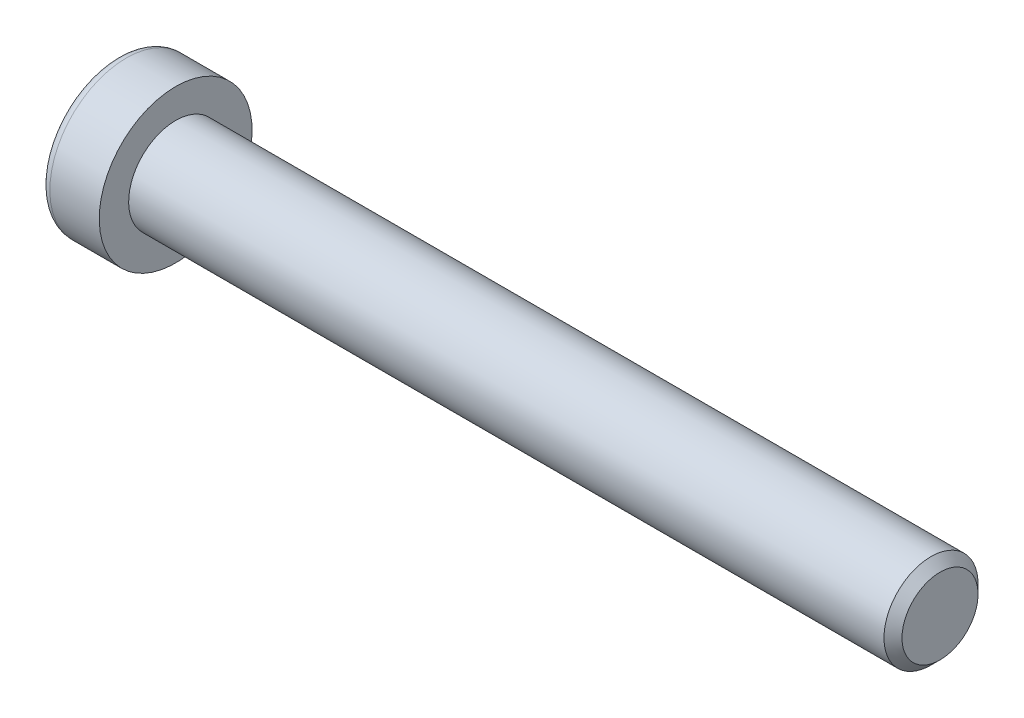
ISO-10303-21;
HEADER;
FILE_DESCRIPTION(('STEP AP214'),'2;1');
FILE_NAME('part.step','',(''),(''),'','','');
FILE_SCHEMA(('AUTOMOTIVE_DESIGN { 1 0 10303 214 1 1 1 1 }'));
ENDSEC;
DATA;
#1=APPLICATION_CONTEXT('core data for automotive mechanical design processes');
#2=APPLICATION_PROTOCOL_DEFINITION('international standard','automotive_design',2000,#1);
#3=PRODUCT_CONTEXT('',#1,'mechanical');
#4=PRODUCT('Part','Part','',(#3));
#5=PRODUCT_RELATED_PRODUCT_CATEGORY('part','',(#4));
#6=PRODUCT_DEFINITION_FORMATION('','',#4);
#7=PRODUCT_DEFINITION_CONTEXT('part definition',#1,'design');
#8=PRODUCT_DEFINITION('design','',#6,#7);
#9=PRODUCT_DEFINITION_SHAPE('','',#8);
#10=(LENGTH_UNIT() NAMED_UNIT(*) SI_UNIT(.MILLI.,.METRE.));
#11=(NAMED_UNIT(*) PLANE_ANGLE_UNIT() SI_UNIT($,.RADIAN.));
#12=(NAMED_UNIT(*) SI_UNIT($,.STERADIAN.) SOLID_ANGLE_UNIT());
#13=UNCERTAINTY_MEASURE_WITH_UNIT(LENGTH_MEASURE(1.E-05),#10,'distance_accuracy_value','');
#14=(GEOMETRIC_REPRESENTATION_CONTEXT(3) GLOBAL_UNCERTAINTY_ASSIGNED_CONTEXT((#13)) GLOBAL_UNIT_ASSIGNED_CONTEXT((#10,
#11,#12)) REPRESENTATION_CONTEXT('',''));
#15=CARTESIAN_POINT('',(0.,0.,0.));
#16=DIRECTION('',(0.,0.,1.));
#17=DIRECTION('',(1.,0.,0.));
#18=AXIS2_PLACEMENT_3D('',#15,#16,#17);
#19=CARTESIAN_POINT('',(-1.21000000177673,0.,0.));
#20=DIRECTION('',(-1.,0.,0.));
#21=DIRECTION('',(0.,0.,1.));
#22=AXIS2_PLACEMENT_3D('',#19,#20,#21);
#23=CONICAL_SURFACE('',#22,2.9040718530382,1.04719754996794);
#24=CARTESIAN_POINT('',(0.466666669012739,-1.13686837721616E-10,0.));
#25=VERTEX_POINT('',#24);
#26=VERTEX_LOOP('',#25);
#27=FACE_BOUND('',#26,.T.);
#28=CARTESIAN_POINT('',(-1.20000000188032,2.50000000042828,1.44337567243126));
#29=CARTESIAN_POINT('',(-1.16336943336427,2.50000000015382,1.31652043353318));
#30=CARTESIAN_POINT('',(-1.13005584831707,2.50000000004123,1.18857018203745));
#31=CARTESIAN_POINT('',(-1.07190798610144,2.49999999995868,0.930454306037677));
#32=CARTESIAN_POINT('',(-1.04709427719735,2.49999999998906,0.800284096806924));
#33=CARTESIAN_POINT('',(-1.00846995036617,2.50000000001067,0.541556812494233));
#34=CARTESIAN_POINT('',(-0.994402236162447,2.50000000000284,0.413039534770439));
#35=CARTESIAN_POINT('',(-0.977611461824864,2.49999999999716,0.155400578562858));
#36=CARTESIAN_POINT('',(-0.974874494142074,2.49999999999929,0.0262798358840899));
#37=CARTESIAN_POINT('',(-0.980582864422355,2.50000000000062,-0.21496841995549));
#38=CARTESIAN_POINT('',(-0.987626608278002,2.50000000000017,-0.327132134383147));
#39=CARTESIAN_POINT('',(-1.00994662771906,2.49999999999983,-0.550728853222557));
#40=CARTESIAN_POINT('',(-1.02523052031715,2.49999999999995,-0.66216108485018));
#41=CARTESIAN_POINT('',(-1.06343729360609,2.50000000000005,-0.886218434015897));
#42=CARTESIAN_POINT('',(-1.08652205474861,2.50000000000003,-0.998815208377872));
#43=CARTESIAN_POINT('',(-1.13891470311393,2.49999999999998,-1.2223298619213));
#44=CARTESIAN_POINT('',(-1.16821028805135,2.49999999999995,-1.33325060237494));
#45=CARTESIAN_POINT('',(-1.20000000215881,2.5,-1.44337567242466));
#46=B_SPLINE_CURVE_WITH_KNOTS('',3,(#28,#29,#30,#31,#32,#33,#34,#35,#36,#37,#38,#39,#40,#41,#42,
#43,#44,#45),.UNSPECIFIED.,.F.,.F.,(4,2,2,2,2,2,2,2,4),(0.,0.396270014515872,0.793492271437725,
1.18088450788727,1.56780111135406,1.90463472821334,2.24178024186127,2.58640202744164,
2.93034746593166),.UNSPECIFIED.);
#47=CARTESIAN_POINT('',(-1.20000000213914,2.49999999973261,1.44337567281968));
#48=VERTEX_POINT('',#47);
#49=CARTESIAN_POINT('',(-1.20000000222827,2.5,-1.44337567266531));
#50=VERTEX_POINT('',#49);
#51=EDGE_CURVE('E20',#48,#50,#46,.T.);
#52=ORIENTED_EDGE('',*,*,#51,.T.);
#53=CARTESIAN_POINT('',(-1.20000000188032,2.49999999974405,-1.44337567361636));
#54=CARTESIAN_POINT('',(-1.16336943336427,2.39014014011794,-1.50680329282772));
#55=CARTESIAN_POINT('',(-1.13005584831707,2.27933197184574,-1.57077841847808));
#56=CARTESIAN_POINT('',(-1.07190798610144,2.05579706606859,-1.69983635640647));
#57=CARTESIAN_POINT('',(-1.04709427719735,1.94306635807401,-1.76492146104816));
#58=CARTESIAN_POINT('',(-1.00846995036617,1.71900195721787,-1.89428510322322));
#59=CARTESIAN_POINT('',(-0.994402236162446,1.60770272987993,-1.95854374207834));
#60=CARTESIAN_POINT('',(-0.977611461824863,1.38458084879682,-2.08736322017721));
#61=CARTESIAN_POINT('',(-0.974874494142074,1.27275900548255,-2.15192359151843));
#62=CARTESIAN_POINT('',(-0.980582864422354,1.06383188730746,-2.27254771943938));
#63=CARTESIAN_POINT('',(-0.987626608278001,0.966695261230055,-2.32862957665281));
#64=CARTESIAN_POINT('',(-1.00994662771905,0.773054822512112,-2.44042793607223));
#65=CARTESIAN_POINT('',(-1.02523052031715,0.676551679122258,-2.49614405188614));
#66=CARTESIAN_POINT('',(-1.06343729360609,0.482512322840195,-2.60817272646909));
#67=CARTESIAN_POINT('',(-1.08652205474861,0.385000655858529,-2.66447111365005));
#68=CARTESIAN_POINT('',(-1.13891470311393,0.191431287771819,-2.77622844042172));
#69=CARTESIAN_POINT('',(-1.16821028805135,0.09537110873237,-2.83168881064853));
#70=CARTESIAN_POINT('',(-1.20000000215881,4.75795614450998E-10,-2.88675134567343));
#71=B_SPLINE_CURVE_WITH_KNOTS('',3,(#53,#54,#55,#56,#57,#58,#59,#60,#61,#62,#63,#64,#65,#66,#67,
#68,#69,#70),.UNSPECIFIED.,.F.,.F.,(4,2,2,2,2,2,2,2,4),(0.,0.396270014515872,0.793492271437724,
1.18088450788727,1.56780111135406,1.90463472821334,2.24178024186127,2.58640202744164,
2.93034746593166),.UNSPECIFIED.);
#72=CARTESIAN_POINT('',(-1.20000000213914,0.,-2.88675134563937));
#73=VERTEX_POINT('',#72);
#74=EDGE_CURVE('E80',#50,#73,#71,.T.);
#75=ORIENTED_EDGE('',*,*,#74,.T.);
#76=CARTESIAN_POINT('',(-1.20000000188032,-6.84219602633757E-10,-2.88675134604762));
#77=CARTESIAN_POINT('',(-1.16336943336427,-0.109859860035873,-2.8233237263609));
#78=CARTESIAN_POINT('',(-1.13005584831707,-0.220668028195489,-2.75934860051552));
#79=CARTESIAN_POINT('',(-1.07190798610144,-0.444202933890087,-2.63029066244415));
#80=CARTESIAN_POINT('',(-1.04709427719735,-0.556933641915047,-2.56520555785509));
#81=CARTESIAN_POINT('',(-1.00846995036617,-0.780998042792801,-2.43584191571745));
#82=CARTESIAN_POINT('',(-0.994402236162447,-0.892297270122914,-2.37158327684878));
#83=CARTESIAN_POINT('',(-0.977611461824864,-1.11541915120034,-2.24276379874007));
#84=CARTESIAN_POINT('',(-0.974874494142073,-1.22724099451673,-2.17820342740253));
#85=CARTESIAN_POINT('',(-0.980582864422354,-1.43616811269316,-2.05757929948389));
#86=CARTESIAN_POINT('',(-0.987626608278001,-1.53330473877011,-2.00149744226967));
#87=CARTESIAN_POINT('',(-1.00994662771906,-1.72694517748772,-1.88969908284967));
#88=CARTESIAN_POINT('',(-1.02523052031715,-1.82344832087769,-1.83398296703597));
#89=CARTESIAN_POINT('',(-1.06343729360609,-2.01748767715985,-1.72195429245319));
#90=CARTESIAN_POINT('',(-1.08652205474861,-2.1149993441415,-1.66565590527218));
#91=CARTESIAN_POINT('',(-1.13891470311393,-2.30856871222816,-1.55389857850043));
#92=CARTESIAN_POINT('',(-1.16821028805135,-2.40462889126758,-1.49843820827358));
#93=CARTESIAN_POINT('',(-1.20000000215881,-2.49999999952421,-1.44337567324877));
#94=B_SPLINE_CURVE_WITH_KNOTS('',3,(#76,#77,#78,#79,#80,#81,#82,#83,#84,#85,#86,#87,#88,#89,#90,
#91,#92,#93),.UNSPECIFIED.,.F.,.F.,(4,2,2,2,2,2,2,2,4),(0.,0.396270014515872,0.793492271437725,
1.18088450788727,1.56780111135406,1.90463472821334,2.24178024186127,2.58640202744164,
2.93034746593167),.UNSPECIFIED.);
#95=CARTESIAN_POINT('',(-1.20000000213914,-2.49999999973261,-1.44337567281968));
#96=VERTEX_POINT('',#95);
#97=EDGE_CURVE('E105',#73,#96,#94,.T.);
#98=ORIENTED_EDGE('',*,*,#97,.T.);
#99=CARTESIAN_POINT('',(-1.20000000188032,-2.50000000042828,-1.44337567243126));
#100=CARTESIAN_POINT('',(-1.16336943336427,-2.50000000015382,-1.31652043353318));
#101=CARTESIAN_POINT('',(-1.13005584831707,-2.50000000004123,-1.18857018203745));
#102=CARTESIAN_POINT('',(-1.07190798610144,-2.49999999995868,-0.93045430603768));
#103=CARTESIAN_POINT('',(-1.04709427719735,-2.49999999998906,-0.800284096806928));
#104=CARTESIAN_POINT('',(-1.00846995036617,-2.50000000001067,-0.541556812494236));
#105=CARTESIAN_POINT('',(-0.994402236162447,-2.50000000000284,-0.413039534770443));
#106=CARTESIAN_POINT('',(-0.977611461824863,-2.49999999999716,-0.155400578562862));
#107=CARTESIAN_POINT('',(-0.974874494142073,-2.49999999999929,-0.0262798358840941));
#108=CARTESIAN_POINT('',(-0.980582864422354,-2.50000000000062,0.214968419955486));
#109=CARTESIAN_POINT('',(-0.987626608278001,-2.50000000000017,0.327132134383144));
#110=CARTESIAN_POINT('',(-1.00994662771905,-2.49999999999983,0.550728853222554));
#111=CARTESIAN_POINT('',(-1.02523052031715,-2.49999999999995,0.662161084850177));
#112=CARTESIAN_POINT('',(-1.06343729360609,-2.50000000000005,0.886218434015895));
#113=CARTESIAN_POINT('',(-1.08652205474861,-2.50000000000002,0.99881520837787));
#114=CARTESIAN_POINT('',(-1.13891470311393,-2.49999999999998,1.2223298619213));
#115=CARTESIAN_POINT('',(-1.16821028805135,-2.49999999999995,1.33325060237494));
#116=CARTESIAN_POINT('',(-1.20000000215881,-2.5,1.44337567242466));
#117=B_SPLINE_CURVE_WITH_KNOTS('',3,(#99,#100,#101,#102,#103,#104,#105,#106,#107,#108,#109,#110,
#111,#112,#113,#114,#115,#116),.UNSPECIFIED.,.F.,.F.,(4,2,2,2,2,2,2,2,4),(0.,0.396270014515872,
0.793492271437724,1.18088450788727,1.56780111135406,1.90463472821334,2.24178024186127,
2.58640202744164,2.93034746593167),.UNSPECIFIED.);
#118=CARTESIAN_POINT('',(-1.20000000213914,-2.49999999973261,1.44337567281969));
#119=VERTEX_POINT('',#118);
#120=EDGE_CURVE('E129',#96,#119,#117,.T.);
#121=ORIENTED_EDGE('',*,*,#120,.T.);
#122=CARTESIAN_POINT('',(-1.20000000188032,-2.49999999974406,1.44337567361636));
#123=CARTESIAN_POINT('',(-1.16336943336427,-2.39014014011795,1.50680329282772));
#124=CARTESIAN_POINT('',(-1.13005584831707,-2.27933197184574,1.57077841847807));
#125=CARTESIAN_POINT('',(-1.07190798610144,-2.05579706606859,1.69983635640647));
#126=CARTESIAN_POINT('',(-1.04709427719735,-1.94306635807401,1.76492146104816));
#127=CARTESIAN_POINT('',(-1.00846995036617,-1.71900195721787,1.89428510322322));
#128=CARTESIAN_POINT('',(-0.994402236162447,-1.60770272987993,1.95854374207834));
#129=CARTESIAN_POINT('',(-0.977611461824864,-1.38458084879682,2.08736322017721));
#130=CARTESIAN_POINT('',(-0.974874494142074,-1.27275900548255,2.15192359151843));
#131=CARTESIAN_POINT('',(-0.980582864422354,-1.06383188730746,2.27254771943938));
#132=CARTESIAN_POINT('',(-0.987626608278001,-0.966695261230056,2.32862957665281));
#133=CARTESIAN_POINT('',(-1.00994662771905,-0.773054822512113,2.44042793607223));
#134=CARTESIAN_POINT('',(-1.02523052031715,-0.676551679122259,2.49614405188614));
#135=CARTESIAN_POINT('',(-1.06343729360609,-0.482512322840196,2.60817272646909));
#136=CARTESIAN_POINT('',(-1.08652205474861,-0.385000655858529,2.66447111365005));
#137=CARTESIAN_POINT('',(-1.13891470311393,-0.19143128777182,2.77622844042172));
#138=CARTESIAN_POINT('',(-1.16821028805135,-0.0953711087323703,2.83168881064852));
#139=CARTESIAN_POINT('',(-1.20000000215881,-4.75795563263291E-10,2.88675134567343));
#140=B_SPLINE_CURVE_WITH_KNOTS('',3,(#122,#123,#124,#125,#126,#127,#128,#129,#130,#131,#132,
#133,#134,#135,#136,#137,#138,#139),.UNSPECIFIED.,.F.,.F.,(4,2,2,2,2,2,2,2,4),(0.,
0.396270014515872,0.793492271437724,1.18088450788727,1.56780111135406,1.90463472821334,
2.24178024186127,2.58640202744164,2.93034746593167),.UNSPECIFIED.);
#141=CARTESIAN_POINT('',(-1.20000000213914,0.,2.88675134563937));
#142=VERTEX_POINT('',#141);
#143=EDGE_CURVE('E137',#119,#142,#140,.T.);
#144=ORIENTED_EDGE('',*,*,#143,.T.);
#145=CARTESIAN_POINT('',(-1.20000000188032,6.84218567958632E-10,2.88675134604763));
#146=CARTESIAN_POINT('',(-1.16336943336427,0.109859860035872,2.8233237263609));
#147=CARTESIAN_POINT('',(-1.13005584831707,0.220668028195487,2.75934860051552));
#148=CARTESIAN_POINT('',(-1.07190798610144,0.444202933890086,2.63029066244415));
#149=CARTESIAN_POINT('',(-1.04709427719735,0.556933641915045,2.56520555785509));
#150=CARTESIAN_POINT('',(-1.00846995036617,0.7809980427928,2.43584191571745));
#151=CARTESIAN_POINT('',(-0.994402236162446,0.892297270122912,2.37158327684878));
#152=CARTESIAN_POINT('',(-0.977611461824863,1.11541915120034,2.24276379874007));
#153=CARTESIAN_POINT('',(-0.974874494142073,1.22724099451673,2.17820342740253));
#154=CARTESIAN_POINT('',(-0.980582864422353,1.43616811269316,2.05757929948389));
#155=CARTESIAN_POINT('',(-0.987626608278,1.53330473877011,2.00149744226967));
#156=CARTESIAN_POINT('',(-1.00994662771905,1.72694517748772,1.88969908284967));
#157=CARTESIAN_POINT('',(-1.02523052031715,1.82344832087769,1.83398296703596));
#158=CARTESIAN_POINT('',(-1.06343729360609,2.01748767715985,1.72195429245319));
#159=CARTESIAN_POINT('',(-1.08652205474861,2.1149993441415,1.66565590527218));
#160=CARTESIAN_POINT('',(-1.13891470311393,2.30856871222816,1.55389857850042));
#161=CARTESIAN_POINT('',(-1.16821028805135,2.40462889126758,1.49843820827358));
#162=CARTESIAN_POINT('',(-1.2000000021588,2.49999999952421,1.44337567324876));
#163=B_SPLINE_CURVE_WITH_KNOTS('',3,(#145,#146,#147,#148,#149,#150,#151,#152,#153,#154,#155,
#156,#157,#158,#159,#160,#161,#162),.UNSPECIFIED.,.F.,.F.,(4,2,2,2,2,2,2,2,4),(0.,
0.396270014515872,0.793492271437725,1.18088450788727,1.56780111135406,1.90463472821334,
2.24178024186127,2.58640202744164,2.93034746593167),.UNSPECIFIED.);
#164=EDGE_CURVE('E82',#142,#48,#163,.T.);
#165=ORIENTED_EDGE('',*,*,#164,.T.);
#166=EDGE_LOOP('',(#52,#75,#98,#121,#144,#165));
#167=FACE_BOUND('',#166,.T.);
#168=ADVANCED_FACE('F16',(#27,#167),#23,.F.);
#169=CARTESIAN_POINT('',(-5.,2.5,1.44337567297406));
#170=DIRECTION('',(0.,1.,0.));
#171=DIRECTION('',(0.,0.,1.));
#172=AXIS2_PLACEMENT_3D('',#169,#170,#171);
#173=PLANE('',#172);
#174=DIRECTION('',(1.,0.,0.));
#175=VECTOR('',#174,1.);
#176=CARTESIAN_POINT('',(-5.,2.5,1.44337567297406));
#177=LINE('',#176,#175);
#178=CARTESIAN_POINT('',(-5.,2.5,1.44337567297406));
#179=VERTEX_POINT('',#178);
#180=EDGE_CURVE('E84',#48,#179,#177,.F.);
#181=ORIENTED_EDGE('',*,*,#180,.T.);
#182=DIRECTION('',(0.,0.,1.));
#183=VECTOR('',#182,1.);
#184=CARTESIAN_POINT('',(-5.,2.5,0.));
#185=LINE('',#184,#183);
#186=CARTESIAN_POINT('',(-5.,2.5,-1.44337567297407));
#187=VERTEX_POINT('',#186);
#188=EDGE_CURVE('E89',#187,#179,#185,.T.);
#189=ORIENTED_EDGE('',*,*,#188,.F.);
#190=DIRECTION('',(1.,0.,0.));
#191=VECTOR('',#190,1.);
#192=CARTESIAN_POINT('',(-5.,2.5,-1.44337567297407));
#193=LINE('',#192,#191);
#194=EDGE_CURVE('E87',#187,#50,#193,.T.);
#195=ORIENTED_EDGE('',*,*,#194,.T.);
#196=ORIENTED_EDGE('',*,*,#51,.F.);
#197=EDGE_LOOP('',(#181,#189,#195,#196));
#198=FACE_BOUND('',#197,.T.);
#199=ADVANCED_FACE('F76',(#198),#173,.F.);
#200=CARTESIAN_POINT('',(-5.,0.,2.88675134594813));
#201=DIRECTION('',(0.,0.500000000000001,0.866025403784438));
#202=DIRECTION('',(0.,-0.866025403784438,0.500000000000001));
#203=AXIS2_PLACEMENT_3D('',#200,#201,#202);
#204=PLANE('',#203);
#205=DIRECTION('',(1.,0.,0.));
#206=VECTOR('',#205,1.);
#207=CARTESIAN_POINT('',(-5.,0.,2.88675134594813));
#208=LINE('',#207,#206);
#209=CARTESIAN_POINT('',(-5.,0.,2.88675134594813));
#210=VERTEX_POINT('',#209);
#211=EDGE_CURVE('E141',#142,#210,#208,.F.);
#212=ORIENTED_EDGE('',*,*,#211,.T.);
#213=DIRECTION('',(0.,-0.866025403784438,0.500000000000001));
#214=VECTOR('',#213,1.);
#215=CARTESIAN_POINT('',(-5.,2.5,1.44337567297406));
#216=LINE('',#215,#214);
#217=EDGE_CURVE('E95',#179,#210,#216,.T.);
#218=ORIENTED_EDGE('',*,*,#217,.F.);
#219=ORIENTED_EDGE('',*,*,#180,.F.);
#220=ORIENTED_EDGE('',*,*,#164,.F.);
#221=EDGE_LOOP('',(#212,#218,#219,#220));
#222=FACE_BOUND('',#221,.T.);
#223=ADVANCED_FACE('F145',(#222),#204,.F.);
#224=CARTESIAN_POINT('',(-5.,-2.5,1.44337567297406));
#225=DIRECTION('',(0.,-0.5,0.866025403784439));
#226=DIRECTION('',(0.,-0.866025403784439,-0.5));
#227=AXIS2_PLACEMENT_3D('',#224,#225,#226);
#228=PLANE('',#227);
#229=DIRECTION('',(1.,0.,0.));
#230=VECTOR('',#229,1.);
#231=CARTESIAN_POINT('',(-5.,-2.5,1.44337567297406));
#232=LINE('',#231,#230);
#233=CARTESIAN_POINT('',(-5.,-2.5,1.44337567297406));
#234=VERTEX_POINT('',#233);
#235=EDGE_CURVE('E136',#119,#234,#232,.F.);
#236=ORIENTED_EDGE('',*,*,#235,.T.);
#237=DIRECTION('',(0.,-0.866025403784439,-0.5));
#238=VECTOR('',#237,1.);
#239=CARTESIAN_POINT('',(-5.,0.,2.88675134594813));
#240=LINE('',#239,#238);
#241=EDGE_CURVE('E224',#210,#234,#240,.T.);
#242=ORIENTED_EDGE('',*,*,#241,.F.);
#243=ORIENTED_EDGE('',*,*,#211,.F.);
#244=ORIENTED_EDGE('',*,*,#143,.F.);
#245=EDGE_LOOP('',(#236,#242,#243,#244));
#246=FACE_BOUND('',#245,.T.);
#247=ADVANCED_FACE('F125',(#246),#228,.F.);
#248=CARTESIAN_POINT('',(-5.,-2.5,-1.44337567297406));
#249=DIRECTION('',(0.,-1.,0.));
#250=DIRECTION('',(0.,0.,-1.));
#251=AXIS2_PLACEMENT_3D('',#248,#249,#250);
#252=PLANE('',#251);
#253=DIRECTION('',(1.,0.,0.));
#254=VECTOR('',#253,1.);
#255=CARTESIAN_POINT('',(-5.,-2.5,-1.44337567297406));
#256=LINE('',#255,#254);
#257=CARTESIAN_POINT('',(-5.,-2.5,-1.44337567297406));
#258=VERTEX_POINT('',#257);
#259=EDGE_CURVE('E135',#96,#258,#256,.F.);
#260=ORIENTED_EDGE('',*,*,#259,.T.);
#261=DIRECTION('',(0.,0.,1.));
#262=VECTOR('',#261,1.);
#263=CARTESIAN_POINT('',(-5.,-2.5,0.));
#264=LINE('',#263,#262);
#265=EDGE_CURVE('E221',#234,#258,#264,.F.);
#266=ORIENTED_EDGE('',*,*,#265,.F.);
#267=ORIENTED_EDGE('',*,*,#235,.F.);
#268=ORIENTED_EDGE('',*,*,#120,.F.);
#269=EDGE_LOOP('',(#260,#266,#267,#268));
#270=FACE_BOUND('',#269,.T.);
#271=ADVANCED_FACE('F121',(#270),#252,.F.);
#272=CARTESIAN_POINT('',(-5.,0.,-2.88675134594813));
#273=DIRECTION('',(0.,-0.5,-0.866025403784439));
#274=DIRECTION('',(0.,0.866025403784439,-0.5));
#275=AXIS2_PLACEMENT_3D('',#272,#273,#274);
#276=PLANE('',#275);
#277=DIRECTION('',(1.,0.,0.));
#278=VECTOR('',#277,1.);
#279=CARTESIAN_POINT('',(-5.,0.,-2.88675134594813));
#280=LINE('',#279,#278);
#281=CARTESIAN_POINT('',(-5.,0.,-2.88675134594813));
#282=VERTEX_POINT('',#281);
#283=EDGE_CURVE('E38',#73,#282,#280,.F.);
#284=ORIENTED_EDGE('',*,*,#283,.T.);
#285=DIRECTION('',(0.,0.866025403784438,-0.500000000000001));
#286=VECTOR('',#285,1.);
#287=CARTESIAN_POINT('',(-5.,-2.5,-1.44337567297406));
#288=LINE('',#287,#286);
#289=EDGE_CURVE('E218',#258,#282,#288,.T.);
#290=ORIENTED_EDGE('',*,*,#289,.F.);
#291=ORIENTED_EDGE('',*,*,#259,.F.);
#292=ORIENTED_EDGE('',*,*,#97,.F.);
#293=EDGE_LOOP('',(#284,#290,#291,#292));
#294=FACE_BOUND('',#293,.T.);
#295=ADVANCED_FACE('F115',(#294),#276,.F.);
#296=CARTESIAN_POINT('',(-5.,2.5,-1.44337567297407));
#297=DIRECTION('',(0.,0.5,-0.866025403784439));
#298=DIRECTION('',(0.,0.866025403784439,0.5));
#299=AXIS2_PLACEMENT_3D('',#296,#297,#298);
#300=PLANE('',#299);
#301=ORIENTED_EDGE('',*,*,#194,.F.);
#302=DIRECTION('',(0.,0.866025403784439,0.5));
#303=VECTOR('',#302,1.);
#304=CARTESIAN_POINT('',(-5.,0.,-2.88675134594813));
#305=LINE('',#304,#303);
#306=EDGE_CURVE('E216',#282,#187,#305,.T.);
#307=ORIENTED_EDGE('',*,*,#306,.F.);
#308=ORIENTED_EDGE('',*,*,#283,.F.);
#309=ORIENTED_EDGE('',*,*,#74,.F.);
#310=EDGE_LOOP('',(#301,#307,#308,#309));
#311=FACE_BOUND('',#310,.T.);
#312=ADVANCED_FACE('F93',(#311),#300,.F.);
#313=CARTESIAN_POINT('',(-5.,4.69337567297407,0.));
#314=DIRECTION('',(-1.,0.,0.));
#315=DIRECTION('',(0.,0.,1.));
#316=AXIS2_PLACEMENT_3D('',#313,#314,#315);
#317=PLANE('',#316);
#318=ORIENTED_EDGE('',*,*,#289,.T.);
#319=ORIENTED_EDGE('',*,*,#306,.T.);
#320=ORIENTED_EDGE('',*,*,#188,.T.);
#321=ORIENTED_EDGE('',*,*,#217,.T.);
#322=ORIENTED_EDGE('',*,*,#241,.T.);
#323=ORIENTED_EDGE('',*,*,#265,.T.);
#324=EDGE_LOOP('',(#318,#319,#320,#321,#322,#323));
#325=FACE_BOUND('',#324,.T.);
#326=CARTESIAN_POINT('',(-5.,0.,0.));
#327=DIRECTION('',(1.,0.,0.));
#328=DIRECTION('',(0.,1.,0.));
#329=AXIS2_PLACEMENT_3D('',#326,#327,#328);
#330=CIRCLE('',#329,5.7);
#331=CARTESIAN_POINT('',(-5.,5.7,0.));
#332=VERTEX_POINT('',#331);
#333=EDGE_CURVE('E193',#332,#332,#330,.T.);
#334=ORIENTED_EDGE('',*,*,#333,.F.);
#335=EDGE_LOOP('',(#334));
#336=FACE_BOUND('',#335,.T.);
#337=ADVANCED_FACE('F114',(#325,#336),#317,.T.);
#338=CARTESIAN_POINT('',(-4.2,0.,0.));
#339=DIRECTION('',(1.,0.,0.));
#340=DIRECTION('',(0.,0.,-1.));
#341=AXIS2_PLACEMENT_3D('',#338,#339,#340);
#342=TOROIDAL_SURFACE('',#341,5.7,0.8);
#343=CARTESIAN_POINT('',(-4.2,0.,0.));
#344=DIRECTION('',(1.,0.,0.));
#345=DIRECTION('',(0.,1.,0.));
#346=AXIS2_PLACEMENT_3D('',#343,#344,#345);
#347=CIRCLE('',#346,6.5);
#348=CARTESIAN_POINT('',(-4.2,6.5,0.));
#349=VERTEX_POINT('',#348);
#350=EDGE_CURVE('E234',#349,#349,#347,.T.);
#351=ORIENTED_EDGE('',*,*,#350,.F.);
#352=EDGE_LOOP('',(#351));
#353=FACE_BOUND('',#352,.T.);
#354=ORIENTED_EDGE('',*,*,#333,.T.);
#355=EDGE_LOOP('',(#354));
#356=FACE_BOUND('',#355,.T.);
#357=ADVANCED_FACE('F177',(#353,#356),#342,.T.);
#358=CARTESIAN_POINT('',(-2.5,0.,0.));
#359=DIRECTION('',(1.,0.,0.));
#360=DIRECTION('',(0.,1.,0.));
#361=AXIS2_PLACEMENT_3D('',#358,#359,#360);
#362=CYLINDRICAL_SURFACE('',#361,6.5);
#363=ORIENTED_EDGE('',*,*,#350,.T.);
#364=EDGE_LOOP('',(#363));
#365=FACE_BOUND('',#364,.T.);
#366=CARTESIAN_POINT('',(0.,0.,0.));
#367=DIRECTION('',(1.,0.,0.));
#368=DIRECTION('',(0.,1.,0.));
#369=AXIS2_PLACEMENT_3D('',#366,#367,#368);
#370=CIRCLE('',#369,6.5);
#371=CARTESIAN_POINT('',(0.,6.5,0.));
#372=VERTEX_POINT('',#371);
#373=EDGE_CURVE('E103',#372,#372,#370,.T.);
#374=ORIENTED_EDGE('',*,*,#373,.F.);
#375=EDGE_LOOP('',(#374));
#376=FACE_BOUND('',#375,.T.);
#377=ADVANCED_FACE('F174',(#365,#376),#362,.T.);
#378=CARTESIAN_POINT('',(65.,2.,0.));
#379=DIRECTION('',(1.,0.,0.));
#380=DIRECTION('',(0.,0.,-1.));
#381=AXIS2_PLACEMENT_3D('',#378,#379,#380);
#382=PLANE('',#381);
#383=CARTESIAN_POINT('',(65.0000000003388,0.,0.));
#384=DIRECTION('',(-1.,0.,0.));
#385=DIRECTION('',(0.,0.,1.));
#386=AXIS2_PLACEMENT_3D('',#383,#384,#385);
#387=CIRCLE('',#386,3.23318750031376);
#388=CARTESIAN_POINT('',(65.0000000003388,0.,3.23318750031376));
#389=VERTEX_POINT('',#388);
#390=EDGE_CURVE('E230',#389,#389,#387,.T.);
#391=ORIENTED_EDGE('',*,*,#390,.F.);
#392=EDGE_LOOP('',(#391));
#393=FACE_BOUND('',#392,.T.);
#394=ADVANCED_FACE('F170',(#393),#382,.T.);
#395=CARTESIAN_POINT('',(0.,5.25,0.));
#396=DIRECTION('',(1.,0.,0.));
#397=DIRECTION('',(0.,0.,-1.));
#398=AXIS2_PLACEMENT_3D('',#395,#396,#397);
#399=PLANE('',#398);
#400=CARTESIAN_POINT('',(0.,0.,0.));
#401=DIRECTION('',(1.,0.,0.));
#402=DIRECTION('',(0.,1.,0.));
#403=AXIS2_PLACEMENT_3D('',#400,#401,#402);
#404=CIRCLE('',#403,4.00000000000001);
#405=CARTESIAN_POINT('',(0.,4.00000000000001,0.));
#406=VERTEX_POINT('',#405);
#407=EDGE_CURVE('E29',#406,#406,#404,.T.);
#408=ORIENTED_EDGE('',*,*,#407,.F.);
#409=EDGE_LOOP('',(#408));
#410=FACE_BOUND('',#409,.T.);
#411=ORIENTED_EDGE('',*,*,#373,.T.);
#412=EDGE_LOOP('',(#411));
#413=FACE_BOUND('',#412,.T.);
#414=ADVANCED_FACE('F163',(#410,#413),#399,.T.);
#415=CARTESIAN_POINT('',(64.2331874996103,0.,0.));
#416=DIRECTION('',(-1.,0.,0.));
#417=DIRECTION('',(0.,0.,1.));
#418=AXIS2_PLACEMENT_3D('',#415,#416,#417);
#419=CONICAL_SURFACE('',#418,3.99999999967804,0.785398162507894);
#420=ORIENTED_EDGE('',*,*,#390,.T.);
#421=EDGE_LOOP('',(#420));
#422=FACE_BOUND('',#421,.T.);
#423=CARTESIAN_POINT('',(64.2331875,0.,0.));
#424=DIRECTION('',(1.,0.,0.));
#425=DIRECTION('',(0.,1.,0.));
#426=AXIS2_PLACEMENT_3D('',#423,#424,#425);
#427=CIRCLE('',#426,4.00000000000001);
#428=CARTESIAN_POINT('',(64.2331875,4.00000000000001,0.));
#429=VERTEX_POINT('',#428);
#430=EDGE_CURVE('E11',#429,#429,#427,.F.);
#431=ORIENTED_EDGE('',*,*,#430,.F.);
#432=EDGE_LOOP('',(#431));
#433=FACE_BOUND('',#432,.T.);
#434=ADVANCED_FACE('F156',(#422,#433),#419,.T.);
#435=CARTESIAN_POINT('',(54.,0.,0.));
#436=DIRECTION('',(1.,0.,0.));
#437=DIRECTION('',(0.,1.,0.));
#438=AXIS2_PLACEMENT_3D('',#435,#436,#437);
#439=CYLINDRICAL_SURFACE('',#438,4.00000000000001);
#440=ORIENTED_EDGE('',*,*,#430,.T.);
#441=EDGE_LOOP('',(#440));
#442=FACE_BOUND('',#441,.T.);
#443=ORIENTED_EDGE('',*,*,#407,.T.);
#444=EDGE_LOOP('',(#443));
#445=FACE_BOUND('',#444,.T.);
#446=ADVANCED_FACE('F154',(#442,#445),#439,.T.);
#447=CLOSED_SHELL('',(#168,#199,#223,#247,#271,#295,#312,#337,#357,#377,#394,#414,#434,#446));
#448=MANIFOLD_SOLID_BREP('B1',#447);
#449=ADVANCED_BREP_SHAPE_REPRESENTATION('',(#18,#448),#14);
#450=SHAPE_DEFINITION_REPRESENTATION(#9,#449);
ENDSEC;
END-ISO-10303-21;
